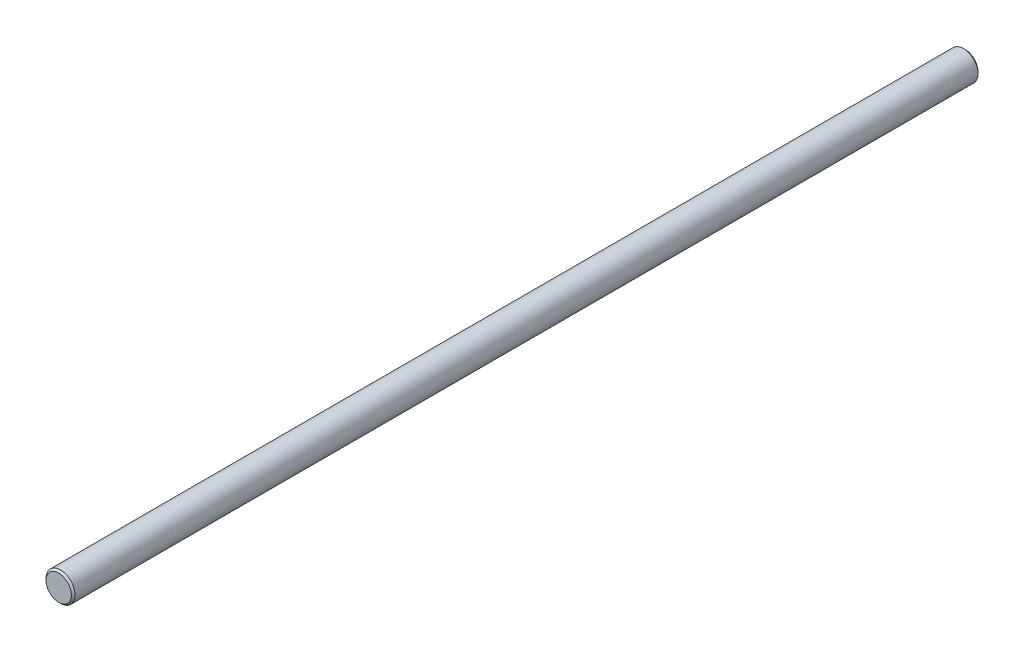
ISO-10303-21;
HEADER;
FILE_DESCRIPTION(('STEP AP214'),'2;1');
FILE_NAME('part.step','',(''),(''),'','','');
FILE_SCHEMA(('AUTOMOTIVE_DESIGN { 1 0 10303 214 1 1 1 1 }'));
ENDSEC;
DATA;
#1=APPLICATION_CONTEXT('core data for automotive mechanical design processes');
#2=APPLICATION_PROTOCOL_DEFINITION('international standard','automotive_design',2000,#1);
#3=PRODUCT_CONTEXT('',#1,'mechanical');
#4=PRODUCT('Part','Part','',(#3));
#5=PRODUCT_RELATED_PRODUCT_CATEGORY('part','',(#4));
#6=PRODUCT_DEFINITION_FORMATION('','',#4);
#7=PRODUCT_DEFINITION_CONTEXT('part definition',#1,'design');
#8=PRODUCT_DEFINITION('design','',#6,#7);
#9=PRODUCT_DEFINITION_SHAPE('','',#8);
#10=(LENGTH_UNIT() NAMED_UNIT(*) SI_UNIT(.MILLI.,.METRE.));
#11=(NAMED_UNIT(*) PLANE_ANGLE_UNIT() SI_UNIT($,.RADIAN.));
#12=(NAMED_UNIT(*) SI_UNIT($,.STERADIAN.) SOLID_ANGLE_UNIT());
#13=UNCERTAINTY_MEASURE_WITH_UNIT(LENGTH_MEASURE(1.E-05),#10,'distance_accuracy_value','');
#14=(GEOMETRIC_REPRESENTATION_CONTEXT(3) GLOBAL_UNCERTAINTY_ASSIGNED_CONTEXT((#13)) GLOBAL_UNIT_ASSIGNED_CONTEXT((#10,
#11,#12)) REPRESENTATION_CONTEXT('',''));
#15=CARTESIAN_POINT('',(0.,0.,0.));
#16=DIRECTION('',(0.,0.,1.));
#17=DIRECTION('',(1.,0.,0.));
#18=AXIS2_PLACEMENT_3D('',#15,#16,#17);
#19=CARTESIAN_POINT('',(0.,0.,250.));
#20=DIRECTION('',(0.,0.,-1.));
#21=DIRECTION('',(-1.,0.,0.));
#22=AXIS2_PLACEMENT_3D('',#19,#20,#21);
#23=PLANE('',#22);
#24=CARTESIAN_POINT('',(0.,0.,250.));
#25=DIRECTION('',(0.,0.,-1.));
#26=DIRECTION('',(0.,1.,0.));
#27=AXIS2_PLACEMENT_3D('',#24,#25,#26);
#28=CIRCLE('',#27,3.49999999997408);
#29=CARTESIAN_POINT('',(0.,3.49999999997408,250.));
#30=VERTEX_POINT('',#29);
#31=EDGE_CURVE('E18',#30,#30,#28,.T.);
#32=ORIENTED_EDGE('',*,*,#31,.F.);
#33=EDGE_LOOP('',(#32));
#34=FACE_BOUND('',#33,.T.);
#35=ADVANCED_FACE('F14',(#34),#23,.F.);
#36=CARTESIAN_POINT('',(0.,0.,0.));
#37=DIRECTION('',(0.,0.,-1.));
#38=DIRECTION('',(-1.,0.,0.));
#39=AXIS2_PLACEMENT_3D('',#36,#37,#38);
#40=PLANE('',#39);
#41=CARTESIAN_POINT('',(0.,0.,0.));
#42=DIRECTION('',(0.,0.,1.));
#43=DIRECTION('',(1.,0.,0.));
#44=AXIS2_PLACEMENT_3D('',#41,#42,#43);
#45=CIRCLE('',#44,3.50000000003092);
#46=CARTESIAN_POINT('',(3.50000000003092,0.,0.));
#47=VERTEX_POINT('',#46);
#48=EDGE_CURVE('E27',#47,#47,#45,.T.);
#49=ORIENTED_EDGE('',*,*,#48,.F.);
#50=EDGE_LOOP('',(#49));
#51=FACE_BOUND('',#50,.T.);
#52=ADVANCED_FACE('F39',(#51),#40,.T.);
#53=CARTESIAN_POINT('',(0.,0.,249.499999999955));
#54=DIRECTION('',(0.,0.,-1.));
#55=DIRECTION('',(0.,1.,0.));
#56=AXIS2_PLACEMENT_3D('',#53,#54,#55);
#57=CONICAL_SURFACE('',#56,4.0000000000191,0.785398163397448);
#58=ORIENTED_EDGE('',*,*,#31,.T.);
#59=EDGE_LOOP('',(#58));
#60=FACE_BOUND('',#59,.T.);
#61=CARTESIAN_POINT('',(0.,0.,249.5));
#62=DIRECTION('',(0.,0.,1.));
#63=DIRECTION('',(1.,0.,0.));
#64=AXIS2_PLACEMENT_3D('',#61,#62,#63);
#65=CIRCLE('',#64,4.);
#66=CARTESIAN_POINT('',(4.,0.,249.5));
#67=VERTEX_POINT('',#66);
#68=EDGE_CURVE('E22',#67,#67,#65,.F.);
#69=ORIENTED_EDGE('',*,*,#68,.F.);
#70=EDGE_LOOP('',(#69));
#71=FACE_BOUND('',#70,.T.);
#72=ADVANCED_FACE('F35',(#60,#71),#57,.T.);
#73=CARTESIAN_POINT('',(0.,0.,0.50000000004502));
#74=DIRECTION('',(0.,0.,1.));
#75=DIRECTION('',(1.,0.,0.));
#76=AXIS2_PLACEMENT_3D('',#73,#74,#75);
#77=CONICAL_SURFACE('',#76,4.0000000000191,0.785398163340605);
#78=ORIENTED_EDGE('',*,*,#48,.T.);
#79=EDGE_LOOP('',(#78));
#80=FACE_BOUND('',#79,.T.);
#81=CARTESIAN_POINT('',(0.,0.,0.5));
#82=DIRECTION('',(0.,0.,1.));
#83=DIRECTION('',(1.,0.,0.));
#84=AXIS2_PLACEMENT_3D('',#81,#82,#83);
#85=CIRCLE('',#84,4.);
#86=CARTESIAN_POINT('',(4.,0.,0.5));
#87=VERTEX_POINT('',#86);
#88=EDGE_CURVE('E9',#87,#87,#85,.T.);
#89=ORIENTED_EDGE('',*,*,#88,.F.);
#90=EDGE_LOOP('',(#89));
#91=FACE_BOUND('',#90,.T.);
#92=ADVANCED_FACE('F47',(#80,#91),#77,.T.);
#93=CARTESIAN_POINT('',(0.,0.,0.));
#94=DIRECTION('',(0.,0.,1.));
#95=DIRECTION('',(1.,0.,0.));
#96=AXIS2_PLACEMENT_3D('',#93,#94,#95);
#97=CYLINDRICAL_SURFACE('',#96,4.);
#98=ORIENTED_EDGE('',*,*,#68,.T.);
#99=EDGE_LOOP('',(#98));
#100=FACE_BOUND('',#99,.T.);
#101=ORIENTED_EDGE('',*,*,#88,.T.);
#102=EDGE_LOOP('',(#101));
#103=FACE_BOUND('',#102,.T.);
#104=ADVANCED_FACE('F16',(#100,#103),#97,.T.);
#105=CLOSED_SHELL('',(#35,#52,#72,#92,#104));
#106=MANIFOLD_SOLID_BREP('B1',#105);
#107=ADVANCED_BREP_SHAPE_REPRESENTATION('',(#18,#106),#14);
#108=SHAPE_DEFINITION_REPRESENTATION(#9,#107);
ENDSEC;
END-ISO-10303-21;
